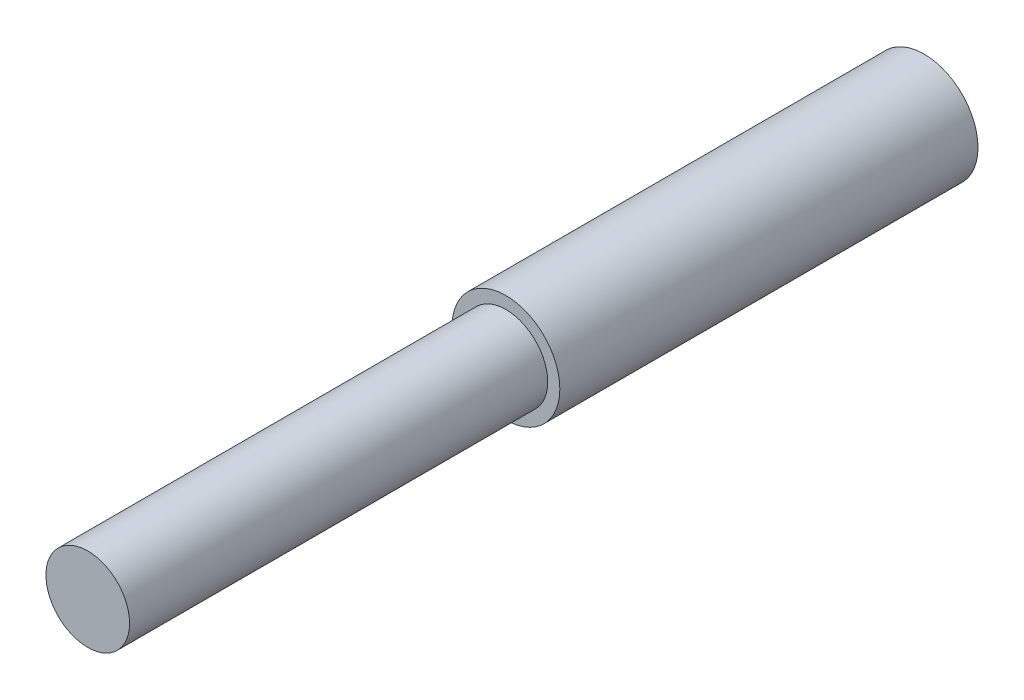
ISO-10303-21;
HEADER;
FILE_DESCRIPTION(('STEP AP214'),'2;1');
FILE_NAME('part.step','',(''),(''),'','','');
FILE_SCHEMA(('AUTOMOTIVE_DESIGN { 1 0 10303 214 1 1 1 1 }'));
ENDSEC;
DATA;
#1=APPLICATION_CONTEXT('core data for automotive mechanical design processes');
#2=APPLICATION_PROTOCOL_DEFINITION('international standard','automotive_design',2000,#1);
#3=PRODUCT_CONTEXT('',#1,'mechanical');
#4=PRODUCT('Part','Part','',(#3));
#5=PRODUCT_RELATED_PRODUCT_CATEGORY('part','',(#4));
#6=PRODUCT_DEFINITION_FORMATION('','',#4);
#7=PRODUCT_DEFINITION_CONTEXT('part definition',#1,'design');
#8=PRODUCT_DEFINITION('design','',#6,#7);
#9=PRODUCT_DEFINITION_SHAPE('','',#8);
#10=(LENGTH_UNIT() NAMED_UNIT(*) SI_UNIT(.MILLI.,.METRE.));
#11=(NAMED_UNIT(*) PLANE_ANGLE_UNIT() SI_UNIT($,.RADIAN.));
#12=(NAMED_UNIT(*) SI_UNIT($,.STERADIAN.) SOLID_ANGLE_UNIT());
#13=UNCERTAINTY_MEASURE_WITH_UNIT(LENGTH_MEASURE(1.E-05),#10,'distance_accuracy_value','');
#14=(GEOMETRIC_REPRESENTATION_CONTEXT(3) GLOBAL_UNCERTAINTY_ASSIGNED_CONTEXT((#13)) GLOBAL_UNIT_ASSIGNED_CONTEXT((#10,
#11,#12)) REPRESENTATION_CONTEXT('',''));
#15=CARTESIAN_POINT('',(0.,0.,0.));
#16=DIRECTION('',(0.,0.,1.));
#17=DIRECTION('',(1.,0.,0.));
#18=AXIS2_PLACEMENT_3D('',#15,#16,#17);
#19=CARTESIAN_POINT('',(0.,0.,48.26));
#20=DIRECTION('',(0.,0.,-1.));
#21=DIRECTION('',(-1.,0.,0.));
#22=AXIS2_PLACEMENT_3D('',#19,#20,#21);
#23=CYLINDRICAL_SURFACE('',#22,6.223);
#24=CARTESIAN_POINT('',(0.,0.,48.26));
#25=DIRECTION('',(0.,0.,1.));
#26=DIRECTION('',(1.,0.,0.));
#27=AXIS2_PLACEMENT_3D('',#24,#25,#26);
#28=CIRCLE('',#27,6.223);
#29=CARTESIAN_POINT('',(6.223,0.,48.26));
#30=VERTEX_POINT('',#29);
#31=EDGE_CURVE('E38',#30,#30,#28,.T.);
#32=ORIENTED_EDGE('',*,*,#31,.F.);
#33=EDGE_LOOP('',(#32));
#34=FACE_BOUND('',#33,.T.);
#35=CARTESIAN_POINT('',(0.,0.,0.));
#36=DIRECTION('',(0.,0.,1.));
#37=DIRECTION('',(1.,0.,0.));
#38=AXIS2_PLACEMENT_3D('',#35,#36,#37);
#39=CIRCLE('',#38,6.223);
#40=CARTESIAN_POINT('',(6.223,0.,0.));
#41=VERTEX_POINT('',#40);
#42=EDGE_CURVE('E34',#41,#41,#39,.T.);
#43=ORIENTED_EDGE('',*,*,#42,.T.);
#44=EDGE_LOOP('',(#43));
#45=FACE_BOUND('',#44,.T.);
#46=ADVANCED_FACE('F31',(#34,#45),#23,.T.);
#47=CARTESIAN_POINT('',(0.,0.,48.26));
#48=DIRECTION('',(0.,0.,1.));
#49=DIRECTION('',(1.,0.,0.));
#50=AXIS2_PLACEMENT_3D('',#47,#48,#49);
#51=PLANE('',#50);
#52=CARTESIAN_POINT('',(0.,0.,48.26));
#53=DIRECTION('',(0.,0.,1.));
#54=DIRECTION('',(1.,0.,0.));
#55=AXIS2_PLACEMENT_3D('',#52,#53,#54);
#56=CIRCLE('',#55,4.826);
#57=CARTESIAN_POINT('',(4.826,0.,48.26));
#58=VERTEX_POINT('',#57);
#59=EDGE_CURVE('E10',#58,#58,#56,.T.);
#60=ORIENTED_EDGE('',*,*,#59,.F.);
#61=EDGE_LOOP('',(#60));
#62=FACE_BOUND('',#61,.T.);
#63=ORIENTED_EDGE('',*,*,#31,.T.);
#64=EDGE_LOOP('',(#63));
#65=FACE_BOUND('',#64,.T.);
#66=ADVANCED_FACE('F55',(#62,#65),#51,.T.);
#67=CARTESIAN_POINT('',(0.,0.,0.));
#68=DIRECTION('',(0.,0.,1.));
#69=DIRECTION('',(1.,0.,0.));
#70=AXIS2_PLACEMENT_3D('',#67,#68,#69);
#71=PLANE('',#70);
#72=ORIENTED_EDGE('',*,*,#42,.F.);
#73=EDGE_LOOP('',(#72));
#74=FACE_BOUND('',#73,.T.);
#75=ADVANCED_FACE('F52',(#74),#71,.F.);
#76=CARTESIAN_POINT('',(0.,0.,96.52));
#77=DIRECTION('',(0.,0.,-1.));
#78=DIRECTION('',(-1.,0.,0.));
#79=AXIS2_PLACEMENT_3D('',#76,#77,#78);
#80=CYLINDRICAL_SURFACE('',#79,4.826);
#81=CARTESIAN_POINT('',(0.,0.,96.52));
#82=DIRECTION('',(0.,0.,1.));
#83=DIRECTION('',(1.,0.,0.));
#84=AXIS2_PLACEMENT_3D('',#81,#82,#83);
#85=CIRCLE('',#84,4.826);
#86=CARTESIAN_POINT('',(4.826,0.,96.52));
#87=VERTEX_POINT('',#86);
#88=EDGE_CURVE('E44',#87,#87,#85,.T.);
#89=ORIENTED_EDGE('',*,*,#88,.F.);
#90=EDGE_LOOP('',(#89));
#91=FACE_BOUND('',#90,.T.);
#92=ORIENTED_EDGE('',*,*,#59,.T.);
#93=EDGE_LOOP('',(#92));
#94=FACE_BOUND('',#93,.T.);
#95=ADVANCED_FACE('F54',(#91,#94),#80,.T.);
#96=CARTESIAN_POINT('',(0.,0.,96.52));
#97=DIRECTION('',(0.,0.,1.));
#98=DIRECTION('',(1.,0.,0.));
#99=AXIS2_PLACEMENT_3D('',#96,#97,#98);
#100=PLANE('',#99);
#101=ORIENTED_EDGE('',*,*,#88,.T.);
#102=EDGE_LOOP('',(#101));
#103=FACE_BOUND('',#102,.T.);
#104=ADVANCED_FACE('F60',(#103),#100,.T.);
#105=CLOSED_SHELL('',(#46,#66,#75,#95,#104));
#106=MANIFOLD_SOLID_BREP('B2',#105);
#107=ADVANCED_BREP_SHAPE_REPRESENTATION('',(#18,#106),#14);
#108=SHAPE_DEFINITION_REPRESENTATION(#9,#107);
ENDSEC;
END-ISO-10303-21;
